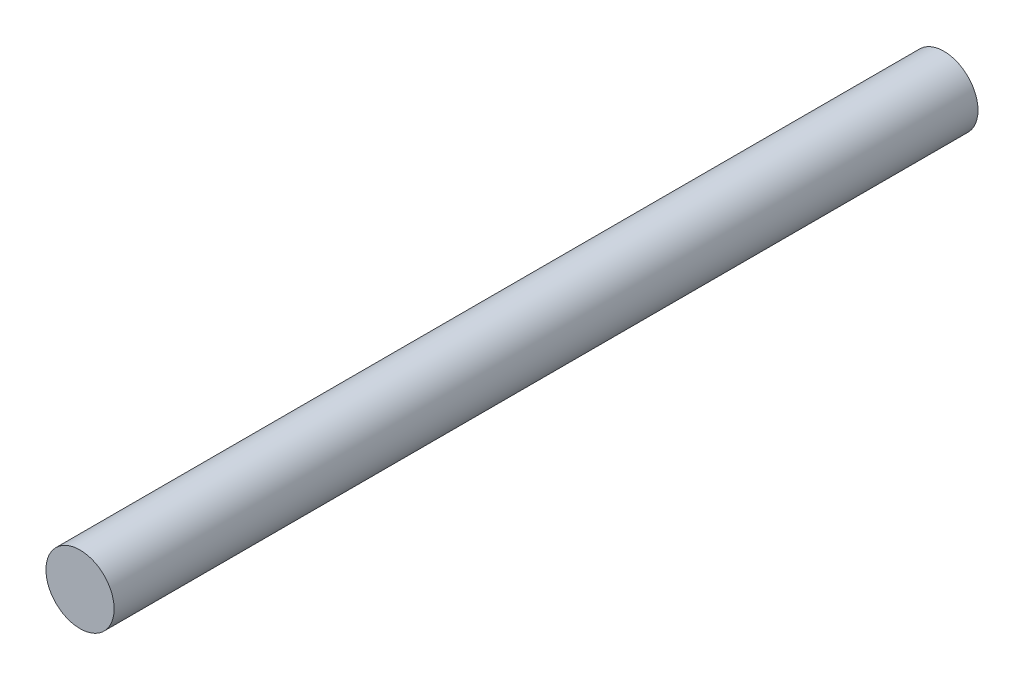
ISO-10303-21;
HEADER;
FILE_DESCRIPTION(('STEP AP214'),'2;1');
FILE_NAME('part.step','',(''),(''),'','','');
FILE_SCHEMA(('AUTOMOTIVE_DESIGN { 1 0 10303 214 1 1 1 1 }'));
ENDSEC;
DATA;
#1=APPLICATION_CONTEXT('core data for automotive mechanical design processes');
#2=APPLICATION_PROTOCOL_DEFINITION('international standard','automotive_design',2000,#1);
#3=PRODUCT_CONTEXT('',#1,'mechanical');
#4=PRODUCT('Part','Part','',(#3));
#5=PRODUCT_RELATED_PRODUCT_CATEGORY('part','',(#4));
#6=PRODUCT_DEFINITION_FORMATION('','',#4);
#7=PRODUCT_DEFINITION_CONTEXT('part definition',#1,'design');
#8=PRODUCT_DEFINITION('design','',#6,#7);
#9=PRODUCT_DEFINITION_SHAPE('','',#8);
#10=(LENGTH_UNIT() NAMED_UNIT(*) SI_UNIT(.MILLI.,.METRE.));
#11=(NAMED_UNIT(*) PLANE_ANGLE_UNIT() SI_UNIT($,.RADIAN.));
#12=(NAMED_UNIT(*) SI_UNIT($,.STERADIAN.) SOLID_ANGLE_UNIT());
#13=UNCERTAINTY_MEASURE_WITH_UNIT(LENGTH_MEASURE(1.E-05),#10,'distance_accuracy_value','');
#14=(GEOMETRIC_REPRESENTATION_CONTEXT(3) GLOBAL_UNCERTAINTY_ASSIGNED_CONTEXT((#13)) GLOBAL_UNIT_ASSIGNED_CONTEXT((#10,
#11,#12)) REPRESENTATION_CONTEXT('',''));
#15=CARTESIAN_POINT('',(0.,0.,0.));
#16=DIRECTION('',(0.,0.,1.));
#17=DIRECTION('',(1.,0.,0.));
#18=AXIS2_PLACEMENT_3D('',#15,#16,#17);
#19=CARTESIAN_POINT('',(0.,0.,-60.325));
#20=DIRECTION('',(0.,0.,1.));
#21=DIRECTION('',(1.,0.,0.));
#22=AXIS2_PLACEMENT_3D('',#19,#20,#21);
#23=CYLINDRICAL_SURFACE('',#22,2.38125);
#24=CARTESIAN_POINT('',(0.,0.,-60.325));
#25=DIRECTION('',(0.,0.,1.));
#26=DIRECTION('',(1.,0.,0.));
#27=AXIS2_PLACEMENT_3D('',#24,#25,#26);
#28=CIRCLE('',#27,2.38125);
#29=CARTESIAN_POINT('',(2.38125,0.,-60.325));
#30=VERTEX_POINT('',#29);
#31=EDGE_CURVE('E10',#30,#30,#28,.T.);
#32=CARTESIAN_POINT('',(0.,0.,0.));
#33=DIRECTION('',(0.,0.,1.));
#34=DIRECTION('',(1.,0.,0.));
#35=AXIS2_PLACEMENT_3D('',#32,#33,#34);
#36=CIRCLE('',#35,2.38125);
#37=CARTESIAN_POINT('',(2.38125,0.,0.));
#38=VERTEX_POINT('',#37);
#39=EDGE_CURVE('E35',#38,#38,#36,.T.);
#40=CARTESIAN_POINT('',(2.38125,0.,-60.325));
#41=CARTESIAN_POINT('',(2.38125,0.,-59.6966145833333));
#42=CARTESIAN_POINT('',(2.38125,0.,-59.0682291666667));
#43=CARTESIAN_POINT('',(2.38125,0.,-57.8114583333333));
#44=CARTESIAN_POINT('',(2.38125,0.,-57.1830729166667));
#45=CARTESIAN_POINT('',(2.38125,0.,-55.9263020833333));
#46=CARTESIAN_POINT('',(2.38125,0.,-55.2979166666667));
#47=CARTESIAN_POINT('',(2.38125,0.,-54.0411458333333));
#48=CARTESIAN_POINT('',(2.38125,0.,-53.4127604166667));
#49=CARTESIAN_POINT('',(2.38125,0.,-52.1559895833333));
#50=CARTESIAN_POINT('',(2.38125,0.,-51.5276041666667));
#51=CARTESIAN_POINT('',(2.38125,0.,-50.2708333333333));
#52=CARTESIAN_POINT('',(2.38125,0.,-49.6424479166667));
#53=CARTESIAN_POINT('',(2.38125,0.,-48.3856770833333));
#54=CARTESIAN_POINT('',(2.38125,0.,-47.7572916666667));
#55=CARTESIAN_POINT('',(2.38125,0.,-46.5005208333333));
#56=CARTESIAN_POINT('',(2.38125,0.,-45.8721354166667));
#57=CARTESIAN_POINT('',(2.38125,0.,-44.6153645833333));
#58=CARTESIAN_POINT('',(2.38125,0.,-43.9869791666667));
#59=CARTESIAN_POINT('',(2.38125,0.,-42.7302083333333));
#60=CARTESIAN_POINT('',(2.38125,0.,-42.1018229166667));
#61=CARTESIAN_POINT('',(2.38125,0.,-40.8450520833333));
#62=CARTESIAN_POINT('',(2.38125,0.,-40.2166666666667));
#63=CARTESIAN_POINT('',(2.38125,0.,-38.9598958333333));
#64=CARTESIAN_POINT('',(2.38125,0.,-38.3315104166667));
#65=CARTESIAN_POINT('',(2.38125,0.,-37.0747395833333));
#66=CARTESIAN_POINT('',(2.38125,0.,-36.4463541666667));
#67=CARTESIAN_POINT('',(2.38125,0.,-35.1895833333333));
#68=CARTESIAN_POINT('',(2.38125,0.,-34.5611979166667));
#69=CARTESIAN_POINT('',(2.38125,0.,-33.3044270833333));
#70=CARTESIAN_POINT('',(2.38125,0.,-32.6760416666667));
#71=CARTESIAN_POINT('',(2.38125,0.,-31.4192708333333));
#72=CARTESIAN_POINT('',(2.38125,0.,-30.7908854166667));
#73=CARTESIAN_POINT('',(2.38125,0.,-29.5341145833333));
#74=CARTESIAN_POINT('',(2.38125,0.,-28.9057291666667));
#75=CARTESIAN_POINT('',(2.38125,0.,-27.6489583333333));
#76=CARTESIAN_POINT('',(2.38125,0.,-27.0205729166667));
#77=CARTESIAN_POINT('',(2.38125,0.,-25.7638020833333));
#78=CARTESIAN_POINT('',(2.38125,0.,-25.1354166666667));
#79=CARTESIAN_POINT('',(2.38125,0.,-23.8786458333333));
#80=CARTESIAN_POINT('',(2.38125,0.,-23.2502604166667));
#81=CARTESIAN_POINT('',(2.38125,0.,-21.9934895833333));
#82=CARTESIAN_POINT('',(2.38125,0.,-21.3651041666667));
#83=CARTESIAN_POINT('',(2.38125,0.,-20.1083333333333));
#84=CARTESIAN_POINT('',(2.38125,0.,-19.4799479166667));
#85=CARTESIAN_POINT('',(2.38125,0.,-18.2231770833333));
#86=CARTESIAN_POINT('',(2.38125,0.,-17.5947916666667));
#87=CARTESIAN_POINT('',(2.38125,0.,-16.3380208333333));
#88=CARTESIAN_POINT('',(2.38125,0.,-15.7096354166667));
#89=CARTESIAN_POINT('',(2.38125,0.,-14.4528645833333));
#90=CARTESIAN_POINT('',(2.38125,0.,-13.8244791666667));
#91=CARTESIAN_POINT('',(2.38125,0.,-12.5677083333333));
#92=CARTESIAN_POINT('',(2.38125,0.,-11.9393229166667));
#93=CARTESIAN_POINT('',(2.38125,0.,-10.6825520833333));
#94=CARTESIAN_POINT('',(2.38125,0.,-10.0541666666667));
#95=CARTESIAN_POINT('',(2.38125,0.,-8.79739583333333));
#96=CARTESIAN_POINT('',(2.38125,0.,-8.16901041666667));
#97=CARTESIAN_POINT('',(2.38125,0.,-6.91223958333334));
#98=CARTESIAN_POINT('',(2.38125,0.,-6.28385416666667));
#99=CARTESIAN_POINT('',(2.38125,0.,-5.02708333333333));
#100=CARTESIAN_POINT('',(2.38125,0.,-4.39869791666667));
#101=CARTESIAN_POINT('',(2.38125,0.,-3.14192708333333));
#102=CARTESIAN_POINT('',(2.38125,0.,-2.51354166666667));
#103=CARTESIAN_POINT('',(2.38125,0.,-1.25677083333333));
#104=CARTESIAN_POINT('',(2.38125,0.,-0.628385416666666));
#105=CARTESIAN_POINT('',(2.38125,0.,0.));
#106=B_SPLINE_CURVE_WITH_KNOTS('',3,(#40,#41,#42,#43,#44,#45,#46,#47,#48,#49,#50,#51,#52,#53,
#54,#55,#56,#57,#58,#59,#60,#61,#62,#63,#64,#65,#66,#67,#68,#69,#70,#71,#72,#73,#74,#75,#76,#77,
#78,#79,#80,#81,#82,#83,#84,#85,#86,#87,#88,#89,#90,#91,#92,#93,#94,#95,#96,#97,#98,#99,#100,
#101,#102,#103,#104,#105),.UNSPECIFIED.,.F.,.F.,(4,2,2,2,2,2,2,2,2,2,2,2,2,2,2,2,2,2,2,2,2,2,2,
2,2,2,2,2,2,2,2,2,4),(0.,1.88515625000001,3.7703125,5.65546875,7.540625,9.42578125,11.3109375,
13.19609375,15.08125,16.96640625,18.8515625,20.73671875,22.621875,24.50703125,26.3921875,
28.27734375,30.1625,32.04765625,33.9328125,35.81796875,37.703125,39.58828125,41.4734375,
43.35859375,45.24375,47.12890625,49.0140625,50.89921875,52.784375,54.66953125,56.5546875,
58.43984375,60.325),.UNSPECIFIED.);
#107=EDGE_CURVE('BSEAM32',#30,#38,#106,.T.);
#108=ORIENTED_EDGE('',*,*,#31,.T.);
#109=ORIENTED_EDGE('',*,*,#39,.F.);
#110=ORIENTED_EDGE('',*,*,#107,.T.);
#111=ORIENTED_EDGE('',*,*,#107,.F.);
#112=EDGE_LOOP('',(#108,#110,#109,#111));
#113=FACE_BOUND('',#112,.T.);
#114=ADVANCED_FACE('F32',(#113),#23,.T.);
#115=CARTESIAN_POINT('',(0.,0.,-60.325));
#116=DIRECTION('',(0.,0.,1.));
#117=DIRECTION('',(1.,0.,0.));
#118=AXIS2_PLACEMENT_3D('',#115,#116,#117);
#119=PLANE('',#118);
#120=ORIENTED_EDGE('',*,*,#31,.F.);
#121=EDGE_LOOP('',(#120));
#122=FACE_BOUND('',#121,.T.);
#123=ADVANCED_FACE('F47',(#122),#119,.F.);
#124=CARTESIAN_POINT('',(0.,0.,0.));
#125=DIRECTION('',(0.,0.,1.));
#126=DIRECTION('',(1.,0.,0.));
#127=AXIS2_PLACEMENT_3D('',#124,#125,#126);
#128=PLANE('',#127);
#129=ORIENTED_EDGE('',*,*,#39,.T.);
#130=EDGE_LOOP('',(#129));
#131=FACE_BOUND('',#130,.T.);
#132=ADVANCED_FACE('F44',(#131),#128,.T.);
#133=CLOSED_SHELL('',(#114,#123,#132));
#134=MANIFOLD_SOLID_BREP('B2',#133);
#135=ADVANCED_BREP_SHAPE_REPRESENTATION('',(#18,#134),#14);
#136=SHAPE_DEFINITION_REPRESENTATION(#9,#135);
ENDSEC;
END-ISO-10303-21;
